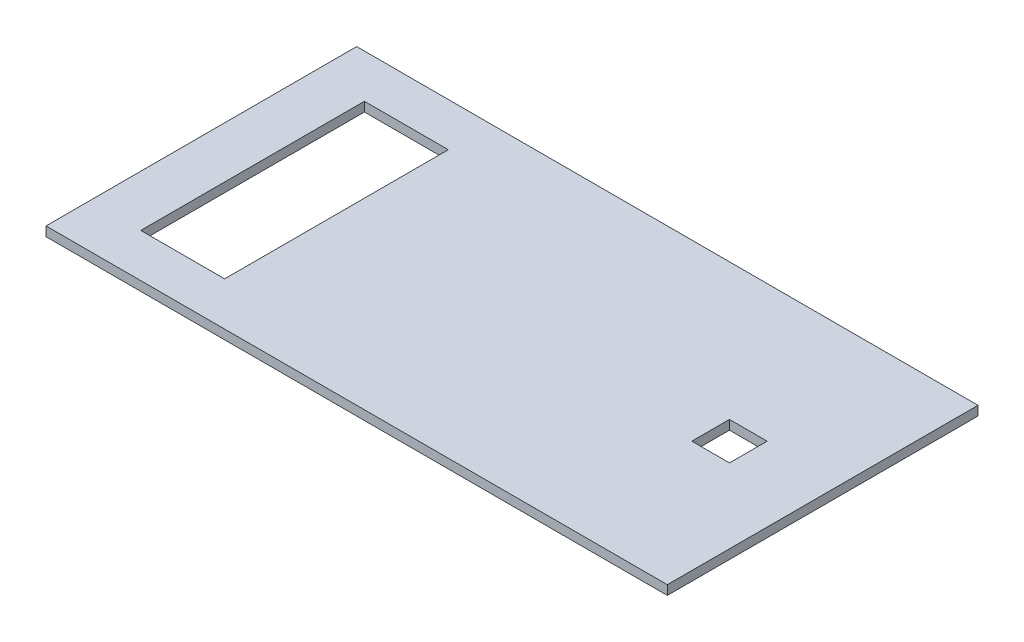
ISO-10303-21;
HEADER;
FILE_DESCRIPTION(('STEP AP214'),'2;1');
FILE_NAME('part.step','',(''),(''),'','','');
FILE_SCHEMA(('AUTOMOTIVE_DESIGN { 1 0 10303 214 1 1 1 1 }'));
ENDSEC;
DATA;
#1=APPLICATION_CONTEXT('core data for automotive mechanical design processes');
#2=APPLICATION_PROTOCOL_DEFINITION('international standard','automotive_design',2000,#1);
#3=PRODUCT_CONTEXT('',#1,'mechanical');
#4=PRODUCT('Part','Part','',(#3));
#5=PRODUCT_RELATED_PRODUCT_CATEGORY('part','',(#4));
#6=PRODUCT_DEFINITION_FORMATION('','',#4);
#7=PRODUCT_DEFINITION_CONTEXT('part definition',#1,'design');
#8=PRODUCT_DEFINITION('design','',#6,#7);
#9=PRODUCT_DEFINITION_SHAPE('','',#8);
#10=(LENGTH_UNIT() NAMED_UNIT(*) SI_UNIT(.MILLI.,.METRE.));
#11=(NAMED_UNIT(*) PLANE_ANGLE_UNIT() SI_UNIT($,.RADIAN.));
#12=(NAMED_UNIT(*) SI_UNIT($,.STERADIAN.) SOLID_ANGLE_UNIT());
#13=UNCERTAINTY_MEASURE_WITH_UNIT(LENGTH_MEASURE(1.E-05),#10,'distance_accuracy_value','');
#14=(GEOMETRIC_REPRESENTATION_CONTEXT(3) GLOBAL_UNCERTAINTY_ASSIGNED_CONTEXT((#13)) GLOBAL_UNIT_ASSIGNED_CONTEXT((#10,
#11,#12)) REPRESENTATION_CONTEXT('',''));
#15=CARTESIAN_POINT('',(0.,0.,0.));
#16=DIRECTION('',(0.,0.,1.));
#17=DIRECTION('',(1.,0.,0.));
#18=AXIS2_PLACEMENT_3D('',#15,#16,#17);
#19=CARTESIAN_POINT('',(100.,-1.5,100.));
#20=DIRECTION('',(-1.,0.,0.));
#21=DIRECTION('',(0.,0.,1.));
#22=AXIS2_PLACEMENT_3D('',#19,#20,#21);
#23=PLANE('',#22);
#24=DIRECTION('',(0.,1.,0.));
#25=VECTOR('',#24,1.);
#26=CARTESIAN_POINT('',(100.,-1.5,0.));
#27=LINE('',#26,#25);
#28=CARTESIAN_POINT('',(100.,-1.5,0.));
#29=VERTEX_POINT('',#28);
#30=CARTESIAN_POINT('',(100.,1.5,0.));
#31=VERTEX_POINT('',#30);
#32=EDGE_CURVE('E164',#29,#31,#27,.T.);
#33=ORIENTED_EDGE('',*,*,#32,.T.);
#34=DIRECTION('',(0.,0.,-1.));
#35=VECTOR('',#34,1.);
#36=CARTESIAN_POINT('',(100.,1.5,100.));
#37=LINE('',#36,#35);
#38=CARTESIAN_POINT('',(100.,1.5,100.));
#39=VERTEX_POINT('',#38);
#40=EDGE_CURVE('E232',#39,#31,#37,.T.);
#41=ORIENTED_EDGE('',*,*,#40,.F.);
#42=DIRECTION('',(0.,1.,0.));
#43=VECTOR('',#42,1.);
#44=CARTESIAN_POINT('',(100.,-1.5,100.));
#45=LINE('',#44,#43);
#46=CARTESIAN_POINT('',(100.,-1.5,100.));
#47=VERTEX_POINT('',#46);
#48=EDGE_CURVE('E195',#47,#39,#45,.T.);
#49=ORIENTED_EDGE('',*,*,#48,.F.);
#50=DIRECTION('',(0.,0.,-1.));
#51=VECTOR('',#50,1.);
#52=CARTESIAN_POINT('',(100.,-1.5,100.));
#53=LINE('',#52,#51);
#54=EDGE_CURVE('E209',#47,#29,#53,.T.);
#55=ORIENTED_EDGE('',*,*,#54,.T.);
#56=EDGE_LOOP('',(#33,#41,#49,#55));
#57=FACE_BOUND('',#56,.T.);
#58=ADVANCED_FACE('F39',(#57),#23,.F.);
#59=CARTESIAN_POINT('',(-100.,1.5,100.));
#60=DIRECTION('',(0.,-1.,0.));
#61=DIRECTION('',(0.,0.,-1.));
#62=AXIS2_PLACEMENT_3D('',#59,#60,#61);
#63=PLANE('',#62);
#64=DIRECTION('',(1.,0.,0.));
#65=VECTOR('',#64,1.);
#66=CARTESIAN_POINT('',(-56.5,1.5,86.));
#67=LINE('',#66,#65);
#68=CARTESIAN_POINT('',(-83.5,1.5,86.));
#69=VERTEX_POINT('',#68);
#70=CARTESIAN_POINT('',(-56.5,1.5,86.));
#71=VERTEX_POINT('',#70);
#72=EDGE_CURVE('E146',#69,#71,#67,.T.);
#73=ORIENTED_EDGE('',*,*,#72,.F.);
#74=DIRECTION('',(0.,0.,1.));
#75=VECTOR('',#74,1.);
#76=CARTESIAN_POINT('',(-83.5,1.5,86.));
#77=LINE('',#76,#75);
#78=CARTESIAN_POINT('',(-83.5,1.5,14.));
#79=VERTEX_POINT('',#78);
#80=EDGE_CURVE('E54',#79,#69,#77,.T.);
#81=ORIENTED_EDGE('',*,*,#80,.F.);
#82=DIRECTION('',(-1.,0.,0.));
#83=VECTOR('',#82,1.);
#84=CARTESIAN_POINT('',(-56.5,1.5,14.));
#85=LINE('',#84,#83);
#86=CARTESIAN_POINT('',(-56.5,1.5,14.));
#87=VERTEX_POINT('',#86);
#88=EDGE_CURVE('E154',#87,#79,#85,.T.);
#89=ORIENTED_EDGE('',*,*,#88,.F.);
#90=DIRECTION('',(0.,0.,-1.));
#91=VECTOR('',#90,1.);
#92=CARTESIAN_POINT('',(-56.5,1.5,86.));
#93=LINE('',#92,#91);
#94=EDGE_CURVE('E135',#71,#87,#93,.T.);
#95=ORIENTED_EDGE('',*,*,#94,.F.);
#96=EDGE_LOOP('',(#73,#81,#89,#95));
#97=FACE_BOUND('',#96,.T.);
#98=DIRECTION('',(-1.,0.,0.));
#99=VECTOR('',#98,1.);
#100=CARTESIAN_POINT('',(63.94,1.5,43.94));
#101=LINE('',#100,#99);
#102=CARTESIAN_POINT('',(76.06,1.5,43.94));
#103=VERTEX_POINT('',#102);
#104=CARTESIAN_POINT('',(63.94,1.5,43.94));
#105=VERTEX_POINT('',#104);
#106=EDGE_CURVE('E171',#103,#105,#101,.T.);
#107=ORIENTED_EDGE('',*,*,#106,.F.);
#108=DIRECTION('',(0.,0.,-1.));
#109=VECTOR('',#108,1.);
#110=CARTESIAN_POINT('',(76.06,1.5,56.06));
#111=LINE('',#110,#109);
#112=CARTESIAN_POINT('',(76.06,1.5,56.06));
#113=VERTEX_POINT('',#112);
#114=EDGE_CURVE('E62',#113,#103,#111,.T.);
#115=ORIENTED_EDGE('',*,*,#114,.F.);
#116=DIRECTION('',(1.,0.,0.));
#117=VECTOR('',#116,1.);
#118=CARTESIAN_POINT('',(63.94,1.5,56.06));
#119=LINE('',#118,#117);
#120=CARTESIAN_POINT('',(63.94,1.5,56.06));
#121=VERTEX_POINT('',#120);
#122=EDGE_CURVE('E179',#121,#113,#119,.T.);
#123=ORIENTED_EDGE('',*,*,#122,.F.);
#124=DIRECTION('',(0.,0.,1.));
#125=VECTOR('',#124,1.);
#126=CARTESIAN_POINT('',(63.94,1.5,56.06));
#127=LINE('',#126,#125);
#128=EDGE_CURVE('E175',#105,#121,#127,.T.);
#129=ORIENTED_EDGE('',*,*,#128,.F.);
#130=EDGE_LOOP('',(#107,#115,#123,#129));
#131=FACE_BOUND('',#130,.T.);
#132=DIRECTION('',(-1.,0.,0.));
#133=VECTOR('',#132,1.);
#134=CARTESIAN_POINT('',(-100.,1.5,0.));
#135=LINE('',#134,#133);
#136=CARTESIAN_POINT('',(-100.,1.5,0.));
#137=VERTEX_POINT('',#136);
#138=EDGE_CURVE('E213',#31,#137,#135,.T.);
#139=ORIENTED_EDGE('',*,*,#138,.T.);
#140=DIRECTION('',(0.,0.,-1.));
#141=VECTOR('',#140,1.);
#142=CARTESIAN_POINT('',(-100.,1.5,100.));
#143=LINE('',#142,#141);
#144=CARTESIAN_POINT('',(-100.,1.5,100.));
#145=VERTEX_POINT('',#144);
#146=EDGE_CURVE('E228',#145,#137,#143,.T.);
#147=ORIENTED_EDGE('',*,*,#146,.F.);
#148=DIRECTION('',(-1.,0.,0.));
#149=VECTOR('',#148,1.);
#150=CARTESIAN_POINT('',(-100.,1.5,100.));
#151=LINE('',#150,#149);
#152=EDGE_CURVE('E199',#39,#145,#151,.T.);
#153=ORIENTED_EDGE('',*,*,#152,.F.);
#154=ORIENTED_EDGE('',*,*,#40,.T.);
#155=EDGE_LOOP('',(#139,#147,#153,#154));
#156=FACE_BOUND('',#155,.T.);
#157=ADVANCED_FACE('F151',(#97,#131,#156),#63,.F.);
#158=CARTESIAN_POINT('',(-100.,-1.5,100.));
#159=DIRECTION('',(1.,0.,0.));
#160=DIRECTION('',(0.,0.,-1.));
#161=AXIS2_PLACEMENT_3D('',#158,#159,#160);
#162=PLANE('',#161);
#163=DIRECTION('',(0.,-1.,0.));
#164=VECTOR('',#163,1.);
#165=CARTESIAN_POINT('',(-100.,-1.5,0.));
#166=LINE('',#165,#164);
#167=CARTESIAN_POINT('',(-100.,-1.5,0.));
#168=VERTEX_POINT('',#167);
#169=EDGE_CURVE('E216',#137,#168,#166,.T.);
#170=ORIENTED_EDGE('',*,*,#169,.T.);
#171=DIRECTION('',(0.,0.,-1.));
#172=VECTOR('',#171,1.);
#173=CARTESIAN_POINT('',(-100.,-1.5,100.));
#174=LINE('',#173,#172);
#175=CARTESIAN_POINT('',(-100.,-1.5,100.));
#176=VERTEX_POINT('',#175);
#177=EDGE_CURVE('E224',#176,#168,#174,.T.);
#178=ORIENTED_EDGE('',*,*,#177,.F.);
#179=DIRECTION('',(0.,-1.,0.));
#180=VECTOR('',#179,1.);
#181=CARTESIAN_POINT('',(-100.,-1.5,100.));
#182=LINE('',#181,#180);
#183=EDGE_CURVE('E203',#145,#176,#182,.T.);
#184=ORIENTED_EDGE('',*,*,#183,.F.);
#185=ORIENTED_EDGE('',*,*,#146,.T.);
#186=EDGE_LOOP('',(#170,#178,#184,#185));
#187=FACE_BOUND('',#186,.T.);
#188=ADVANCED_FACE('F283',(#187),#162,.F.);
#189=CARTESIAN_POINT('',(-100.,-1.5,100.));
#190=DIRECTION('',(0.,1.,0.));
#191=DIRECTION('',(0.,0.,1.));
#192=AXIS2_PLACEMENT_3D('',#189,#190,#191);
#193=PLANE('',#192);
#194=DIRECTION('',(-1.,0.,0.));
#195=VECTOR('',#194,1.);
#196=CARTESIAN_POINT('',(-100.,-1.5,14.));
#197=LINE('',#196,#195);
#198=CARTESIAN_POINT('',(-56.5,-1.5,14.));
#199=VERTEX_POINT('',#198);
#200=CARTESIAN_POINT('',(-83.5,-1.5,14.));
#201=VERTEX_POINT('',#200);
#202=EDGE_CURVE('E47',#199,#201,#197,.T.);
#203=ORIENTED_EDGE('',*,*,#202,.T.);
#204=DIRECTION('',(0.,0.,1.));
#205=VECTOR('',#204,1.);
#206=CARTESIAN_POINT('',(-83.5,-1.5,100.));
#207=LINE('',#206,#205);
#208=CARTESIAN_POINT('',(-83.5,-1.5,86.));
#209=VERTEX_POINT('',#208);
#210=EDGE_CURVE('E11',#201,#209,#207,.T.);
#211=ORIENTED_EDGE('',*,*,#210,.T.);
#212=DIRECTION('',(1.,0.,0.));
#213=VECTOR('',#212,1.);
#214=CARTESIAN_POINT('',(-100.,-1.5,86.));
#215=LINE('',#214,#213);
#216=CARTESIAN_POINT('',(-56.5,-1.5,86.));
#217=VERTEX_POINT('',#216);
#218=EDGE_CURVE('E252',#209,#217,#215,.T.);
#219=ORIENTED_EDGE('',*,*,#218,.T.);
#220=DIRECTION('',(0.,0.,-1.));
#221=VECTOR('',#220,1.);
#222=CARTESIAN_POINT('',(-56.5,-1.5,100.));
#223=LINE('',#222,#221);
#224=EDGE_CURVE('E138',#217,#199,#223,.T.);
#225=ORIENTED_EDGE('',*,*,#224,.T.);
#226=EDGE_LOOP('',(#203,#211,#219,#225));
#227=FACE_BOUND('',#226,.T.);
#228=DIRECTION('',(1.,0.,0.));
#229=VECTOR('',#228,1.);
#230=CARTESIAN_POINT('',(-100.,-1.5,56.06));
#231=LINE('',#230,#229);
#232=CARTESIAN_POINT('',(63.94,-1.5,56.06));
#233=VERTEX_POINT('',#232);
#234=CARTESIAN_POINT('',(76.06,-1.5,56.06));
#235=VERTEX_POINT('',#234);
#236=EDGE_CURVE('E244',#233,#235,#231,.T.);
#237=ORIENTED_EDGE('',*,*,#236,.T.);
#238=DIRECTION('',(0.,0.,-1.));
#239=VECTOR('',#238,1.);
#240=CARTESIAN_POINT('',(76.06,-1.5,100.));
#241=LINE('',#240,#239);
#242=CARTESIAN_POINT('',(76.06,-1.5,43.94));
#243=VERTEX_POINT('',#242);
#244=EDGE_CURVE('E248',#235,#243,#241,.T.);
#245=ORIENTED_EDGE('',*,*,#244,.T.);
#246=DIRECTION('',(-1.,0.,0.));
#247=VECTOR('',#246,1.);
#248=CARTESIAN_POINT('',(-100.,-1.5,43.94));
#249=LINE('',#248,#247);
#250=CARTESIAN_POINT('',(63.94,-1.5,43.94));
#251=VERTEX_POINT('',#250);
#252=EDGE_CURVE('E236',#243,#251,#249,.T.);
#253=ORIENTED_EDGE('',*,*,#252,.T.);
#254=DIRECTION('',(0.,0.,1.));
#255=VECTOR('',#254,1.);
#256=CARTESIAN_POINT('',(63.94,-1.5,100.));
#257=LINE('',#256,#255);
#258=EDGE_CURVE('E240',#251,#233,#257,.T.);
#259=ORIENTED_EDGE('',*,*,#258,.T.);
#260=EDGE_LOOP('',(#237,#245,#253,#259));
#261=FACE_BOUND('',#260,.T.);
#262=DIRECTION('',(1.,0.,0.));
#263=VECTOR('',#262,1.);
#264=CARTESIAN_POINT('',(-100.,-1.5,0.));
#265=LINE('',#264,#263);
#266=EDGE_CURVE('E200',#168,#29,#265,.T.);
#267=ORIENTED_EDGE('',*,*,#266,.T.);
#268=ORIENTED_EDGE('',*,*,#54,.F.);
#269=DIRECTION('',(1.,0.,0.));
#270=VECTOR('',#269,1.);
#271=CARTESIAN_POINT('',(-100.,-1.5,100.));
#272=LINE('',#271,#270);
#273=EDGE_CURVE('E206',#176,#47,#272,.T.);
#274=ORIENTED_EDGE('',*,*,#273,.F.);
#275=ORIENTED_EDGE('',*,*,#177,.T.);
#276=EDGE_LOOP('',(#267,#268,#274,#275));
#277=FACE_BOUND('',#276,.T.);
#278=ADVANCED_FACE('F259',(#227,#261,#277),#193,.F.);
#279=CARTESIAN_POINT('',(0.,0.,100.));
#280=DIRECTION('',(0.,0.,-1.));
#281=DIRECTION('',(-1.,0.,0.));
#282=AXIS2_PLACEMENT_3D('',#279,#280,#281);
#283=PLANE('',#282);
#284=ORIENTED_EDGE('',*,*,#48,.T.);
#285=ORIENTED_EDGE('',*,*,#152,.T.);
#286=ORIENTED_EDGE('',*,*,#183,.T.);
#287=ORIENTED_EDGE('',*,*,#273,.T.);
#288=EDGE_LOOP('',(#284,#285,#286,#287));
#289=FACE_BOUND('',#288,.T.);
#290=ADVANCED_FACE('F296',(#289),#283,.F.);
#291=CARTESIAN_POINT('',(0.,0.,0.));
#292=DIRECTION('',(0.,0.,-1.));
#293=DIRECTION('',(-1.,0.,0.));
#294=AXIS2_PLACEMENT_3D('',#291,#292,#293);
#295=PLANE('',#294);
#296=ORIENTED_EDGE('',*,*,#32,.F.);
#297=ORIENTED_EDGE('',*,*,#266,.F.);
#298=ORIENTED_EDGE('',*,*,#169,.F.);
#299=ORIENTED_EDGE('',*,*,#138,.F.);
#300=EDGE_LOOP('',(#296,#297,#298,#299));
#301=FACE_BOUND('',#300,.T.);
#302=ADVANCED_FACE('F290',(#301),#295,.T.);
#303=CARTESIAN_POINT('',(76.06,-98.5,56.06));
#304=DIRECTION('',(1.,0.,0.));
#305=DIRECTION('',(0.,0.,-1.));
#306=AXIS2_PLACEMENT_3D('',#303,#304,#305);
#307=PLANE('',#306);
#308=DIRECTION('',(0.,1.,0.));
#309=VECTOR('',#308,1.);
#310=CARTESIAN_POINT('',(76.06,-98.5,56.06));
#311=LINE('',#310,#309);
#312=EDGE_CURVE('E184',#235,#113,#311,.T.);
#313=ORIENTED_EDGE('',*,*,#312,.T.);
#314=ORIENTED_EDGE('',*,*,#114,.T.);
#315=DIRECTION('',(0.,1.,0.));
#316=VECTOR('',#315,1.);
#317=CARTESIAN_POINT('',(76.06,-98.5,43.94));
#318=LINE('',#317,#316);
#319=EDGE_CURVE('E183',#243,#103,#318,.T.);
#320=ORIENTED_EDGE('',*,*,#319,.F.);
#321=ORIENTED_EDGE('',*,*,#244,.F.);
#322=EDGE_LOOP('',(#313,#314,#320,#321));
#323=FACE_BOUND('',#322,.T.);
#324=ADVANCED_FACE('F310',(#323),#307,.F.);
#325=CARTESIAN_POINT('',(63.94,-98.5,56.06));
#326=DIRECTION('',(0.,0.,1.));
#327=DIRECTION('',(1.,0.,0.));
#328=AXIS2_PLACEMENT_3D('',#325,#326,#327);
#329=PLANE('',#328);
#330=DIRECTION('',(0.,1.,0.));
#331=VECTOR('',#330,1.);
#332=CARTESIAN_POINT('',(63.94,-98.5,56.06));
#333=LINE('',#332,#331);
#334=EDGE_CURVE('E187',#233,#121,#333,.T.);
#335=ORIENTED_EDGE('',*,*,#334,.T.);
#336=ORIENTED_EDGE('',*,*,#122,.T.);
#337=ORIENTED_EDGE('',*,*,#312,.F.);
#338=ORIENTED_EDGE('',*,*,#236,.F.);
#339=EDGE_LOOP('',(#335,#336,#337,#338));
#340=FACE_BOUND('',#339,.T.);
#341=ADVANCED_FACE('F314',(#340),#329,.F.);
#342=CARTESIAN_POINT('',(63.94,-98.5,56.06));
#343=DIRECTION('',(-1.,0.,0.));
#344=DIRECTION('',(0.,0.,1.));
#345=AXIS2_PLACEMENT_3D('',#342,#343,#344);
#346=PLANE('',#345);
#347=DIRECTION('',(0.,1.,0.));
#348=VECTOR('',#347,1.);
#349=CARTESIAN_POINT('',(63.94,-98.5,43.94));
#350=LINE('',#349,#348);
#351=EDGE_CURVE('E190',#251,#105,#350,.T.);
#352=ORIENTED_EDGE('',*,*,#351,.T.);
#353=ORIENTED_EDGE('',*,*,#128,.T.);
#354=ORIENTED_EDGE('',*,*,#334,.F.);
#355=ORIENTED_EDGE('',*,*,#258,.F.);
#356=EDGE_LOOP('',(#352,#353,#354,#355));
#357=FACE_BOUND('',#356,.T.);
#358=ADVANCED_FACE('F273',(#357),#346,.F.);
#359=CARTESIAN_POINT('',(63.94,-98.5,43.94));
#360=DIRECTION('',(0.,0.,-1.));
#361=DIRECTION('',(-1.,0.,0.));
#362=AXIS2_PLACEMENT_3D('',#359,#360,#361);
#363=PLANE('',#362);
#364=ORIENTED_EDGE('',*,*,#319,.T.);
#365=ORIENTED_EDGE('',*,*,#106,.T.);
#366=ORIENTED_EDGE('',*,*,#351,.F.);
#367=ORIENTED_EDGE('',*,*,#252,.F.);
#368=EDGE_LOOP('',(#364,#365,#366,#367));
#369=FACE_BOUND('',#368,.T.);
#370=ADVANCED_FACE('F266',(#369),#363,.F.);
#371=CARTESIAN_POINT('',(-83.5,-98.5,86.));
#372=DIRECTION('',(-1.,0.,0.));
#373=DIRECTION('',(0.,0.,1.));
#374=AXIS2_PLACEMENT_3D('',#371,#372,#373);
#375=PLANE('',#374);
#376=DIRECTION('',(0.,1.,0.));
#377=VECTOR('',#376,1.);
#378=CARTESIAN_POINT('',(-83.5,-98.5,14.));
#379=LINE('',#378,#377);
#380=EDGE_CURVE('E161',#201,#79,#379,.T.);
#381=ORIENTED_EDGE('',*,*,#380,.T.);
#382=ORIENTED_EDGE('',*,*,#80,.T.);
#383=DIRECTION('',(0.,1.,0.));
#384=VECTOR('',#383,1.);
#385=CARTESIAN_POINT('',(-83.5,-98.5,86.));
#386=LINE('',#385,#384);
#387=EDGE_CURVE('E143',#209,#69,#386,.T.);
#388=ORIENTED_EDGE('',*,*,#387,.F.);
#389=ORIENTED_EDGE('',*,*,#210,.F.);
#390=EDGE_LOOP('',(#381,#382,#388,#389));
#391=FACE_BOUND('',#390,.T.);
#392=ADVANCED_FACE('F264',(#391),#375,.F.);
#393=CARTESIAN_POINT('',(-56.5,-98.5,14.));
#394=DIRECTION('',(0.,0.,-1.));
#395=DIRECTION('',(-1.,0.,0.));
#396=AXIS2_PLACEMENT_3D('',#393,#394,#395);
#397=PLANE('',#396);
#398=DIRECTION('',(0.,1.,0.));
#399=VECTOR('',#398,1.);
#400=CARTESIAN_POINT('',(-56.5,-98.5,14.));
#401=LINE('',#400,#399);
#402=EDGE_CURVE('E142',#199,#87,#401,.T.);
#403=ORIENTED_EDGE('',*,*,#402,.T.);
#404=ORIENTED_EDGE('',*,*,#88,.T.);
#405=ORIENTED_EDGE('',*,*,#380,.F.);
#406=ORIENTED_EDGE('',*,*,#202,.F.);
#407=EDGE_LOOP('',(#403,#404,#405,#406));
#408=FACE_BOUND('',#407,.T.);
#409=ADVANCED_FACE('F263',(#408),#397,.F.);
#410=CARTESIAN_POINT('',(-56.5,-98.5,86.));
#411=DIRECTION('',(1.,0.,0.));
#412=DIRECTION('',(0.,0.,-1.));
#413=AXIS2_PLACEMENT_3D('',#410,#411,#412);
#414=PLANE('',#413);
#415=DIRECTION('',(0.,1.,0.));
#416=VECTOR('',#415,1.);
#417=CARTESIAN_POINT('',(-56.5,-98.5,86.));
#418=LINE('',#417,#416);
#419=EDGE_CURVE('E130',#217,#71,#418,.T.);
#420=ORIENTED_EDGE('',*,*,#419,.T.);
#421=ORIENTED_EDGE('',*,*,#94,.T.);
#422=ORIENTED_EDGE('',*,*,#402,.F.);
#423=ORIENTED_EDGE('',*,*,#224,.F.);
#424=EDGE_LOOP('',(#420,#421,#422,#423));
#425=FACE_BOUND('',#424,.T.);
#426=ADVANCED_FACE('F132',(#425),#414,.F.);
#427=CARTESIAN_POINT('',(-56.5,-98.5,86.));
#428=DIRECTION('',(0.,0.,1.));
#429=DIRECTION('',(1.,0.,0.));
#430=AXIS2_PLACEMENT_3D('',#427,#428,#429);
#431=PLANE('',#430);
#432=ORIENTED_EDGE('',*,*,#387,.T.);
#433=ORIENTED_EDGE('',*,*,#72,.T.);
#434=ORIENTED_EDGE('',*,*,#419,.F.);
#435=ORIENTED_EDGE('',*,*,#218,.F.);
#436=EDGE_LOOP('',(#432,#433,#434,#435));
#437=FACE_BOUND('',#436,.T.);
#438=ADVANCED_FACE('F147',(#437),#431,.F.);
#439=CLOSED_SHELL('',(#58,#157,#188,#278,#290,#302,#324,#341,#358,#370,#392,#409,#426,#438));
#440=MANIFOLD_SOLID_BREP('B2',#439);
#441=ADVANCED_BREP_SHAPE_REPRESENTATION('',(#18,#440),#14);
#442=SHAPE_DEFINITION_REPRESENTATION(#9,#441);
ENDSEC;
END-ISO-10303-21;
